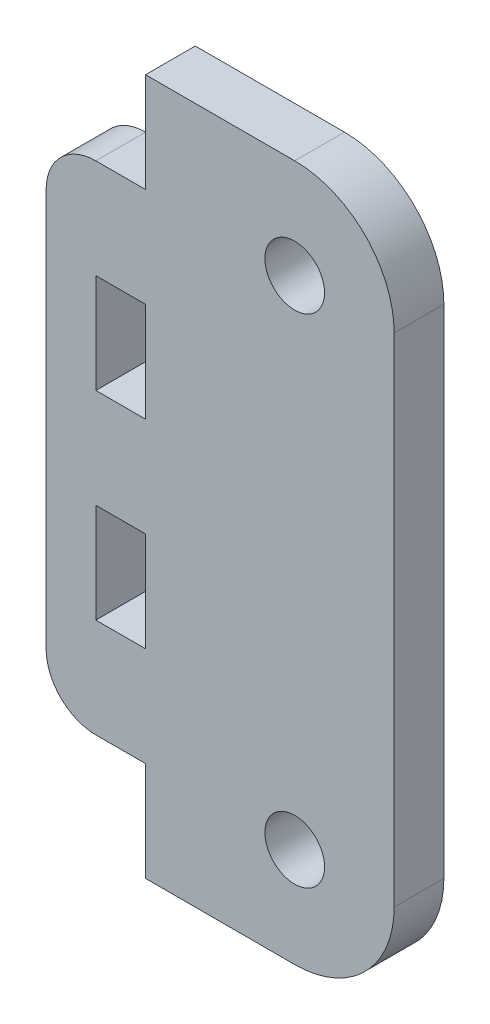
from build123d import *

# Parameters (mm, degrees)
ESQUISSE1_W             = 30
ESQUISSE1_H             = 70
BOSS_EXTRU_1_DEPTH      = 5
ESQUISSE2_W             = 10
ESQUISSE2_H             = 5
ENL_V_MAT_EXTRU_1_DEPTH = 5
ESQUISSE3_W             = 5
ESQUISSE3_H             = 10
ENL_V_MAT_EXTRU_2_DEPTH = 10
ESQUISSE4_W             = 5
ESQUISSE4_H             = 70
BOSS_EXTRU_2_DEPTH      = 25
ESQUISSE5_R             = 3
ENL_V_MAT_EXTRU_3_DEPTH = 5
CONG_1_R                = 10
ENL_V_MAT_EXTRU_4_DEPTH = 10
CONG_2_R                = 5


with BuildPart() as part:
    # Esquisse1 → Boss.-Extru.1 (new body)
    with BuildSketch(Plane.XY):
        with Locations((-15, 0)):
            Rectangle(ESQUISSE1_W, ESQUISSE1_H)
    extrude(amount=BOSS_EXTRU_1_DEPTH)

    # Esquisse2 → Enl_v. mat.-Extru.1 (cut)
    with BuildSketch(Plane.XY.offset(5)):
        with Locations((-20, 2.5)):
            Rectangle(ESQUISSE2_W, ESQUISSE2_H)
    extrude(amount=-ENL_V_MAT_EXTRU_1_DEPTH, mode=Mode.SUBTRACT)

    # Esquisse3 → Enl_v. mat.-Extru.2 (cut)
    with BuildSketch(Plane.XY.offset(5)):
        with Locations((-2.5, -30)):
            Rectangle(ESQUISSE3_W, ESQUISSE3_H)
        with Locations((-2.5, -10)):
            Rectangle(ESQUISSE3_W, ESQUISSE3_H)
        with Locations((-2.5, 10)):
            Rectangle(ESQUISSE3_W, ESQUISSE3_H)
        with Locations((-2.5, 30)):
            Rectangle(ESQUISSE3_W, ESQUISSE3_H)
    extrude(amount=-ENL_V_MAT_EXTRU_2_DEPTH, mode=Mode.SUBTRACT)

    # Esquisse4 → Boss.-Extru.2 (add)
    with BuildSketch(Plane(origin=(0, 0, 0), x_dir=(0, 0, -1), z_dir=(1, 0, 0))):
        with Locations((-2.5, 0)):
            Rectangle(ESQUISSE4_W, ESQUISSE4_H)
    extrude(amount=BOSS_EXTRU_2_DEPTH)

    # Esquisse5 → Enl_v. mat.-Extru.3 (cut)
    with BuildSketch(Plane.XY.offset(5)):
        with Locations((15, 25)):
            Circle(ESQUISSE5_R)
        with Locations((15, -25)):
            Circle(ESQUISSE5_R)
    extrude(amount=-ENL_V_MAT_EXTRU_3_DEPTH, mode=Mode.SUBTRACT)

    # Cong_1
    cong_1_edges = [part.edges().sort_by_distance(p)[0] for p in [
        (25, -35, 2.5),
        (25, 35, 2.5),
    ]]
    fillet(cong_1_edges, radius=CONG_1_R)

    # Esquisse6 → Enl_v. mat.-Extru.4 (cut)
    with BuildSketch(Plane.XY.offset(5)):
        Polygon((-30, -35), (-10, -35), (-5, -35), (-5, -25), (-10, -25), (-10, 25), (-5, 25), (-5, 35), (-10, 35), (-30, 35), align=None)
    extrude(amount=-ENL_V_MAT_EXTRU_4_DEPTH, mode=Mode.SUBTRACT)

    # Cong_2
    cong_2_edges = [part.edges().sort_by_distance(p)[0] for p in [
        (-10, 25, 2.5),
        (-10, -25, 2.5),
    ]]
    fillet(cong_2_edges, radius=CONG_2_R)


solid = part.part
